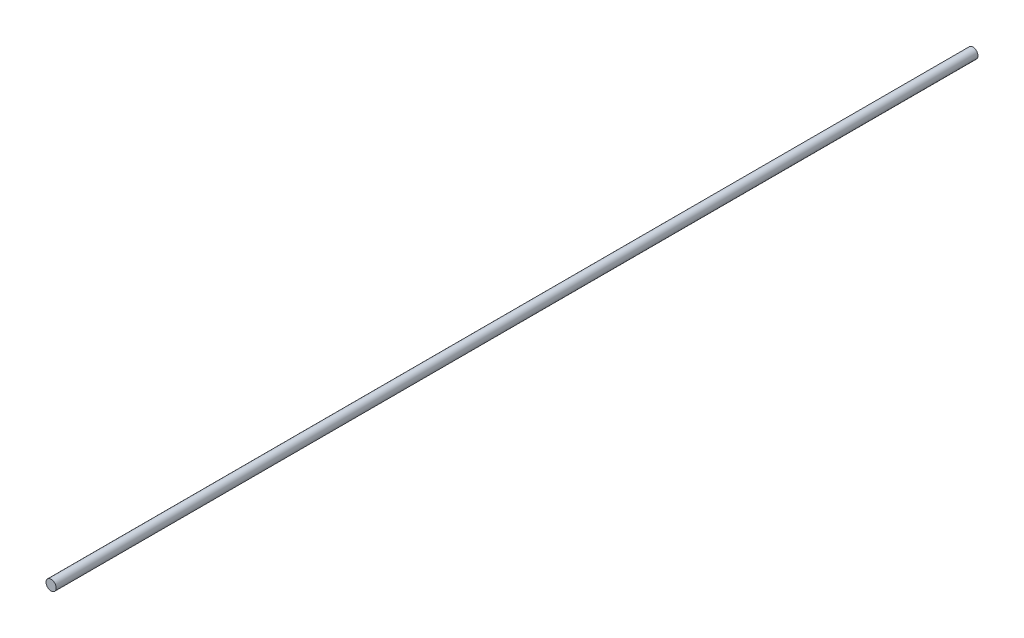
from build123d import *

# Parameters (mm, degrees)
SKETCH1_R           = 30
BOSS_EXTRUDE1_DEPTH = 5450


with BuildPart() as part:
    # Sketch1 → Boss-Extrude1 (new body)
    with BuildSketch(Plane.XY):
        Circle(SKETCH1_R)
    extrude(amount=-BOSS_EXTRUDE1_DEPTH)


solid = part.part
